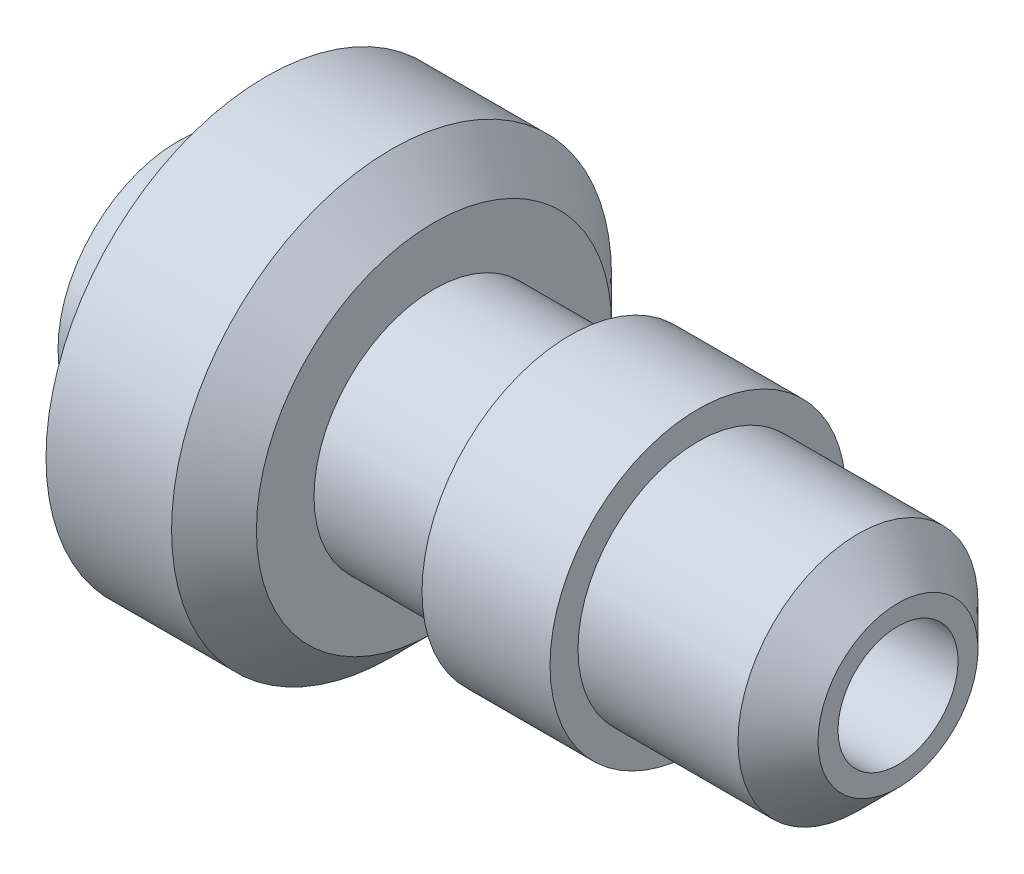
from build123d import *


with BuildPart() as part:
    # Sketch1 → Revolve1 (revolve)
    with BuildSketch(Plane.XY, mode=Mode.PRIVATE) as revolve1_sk:
        Polygon((0, 0), (128, 0), (128, 15), (180, 15), (180, 20), (170, 30), (130, 30), (130, 37), (98, 37), (98, 30), (64, 30), (64, 44.393398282), (53.393398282, 55), (22, 55), (22, 30), (0, 30), align=None)
    revolve(revolve1_sk.sketch.rotate(Axis((0, 0, 0), (1, 0, 0)), 90), axis=Axis((0, 0, 0), (1, 0, 0)))


solid = part.part
